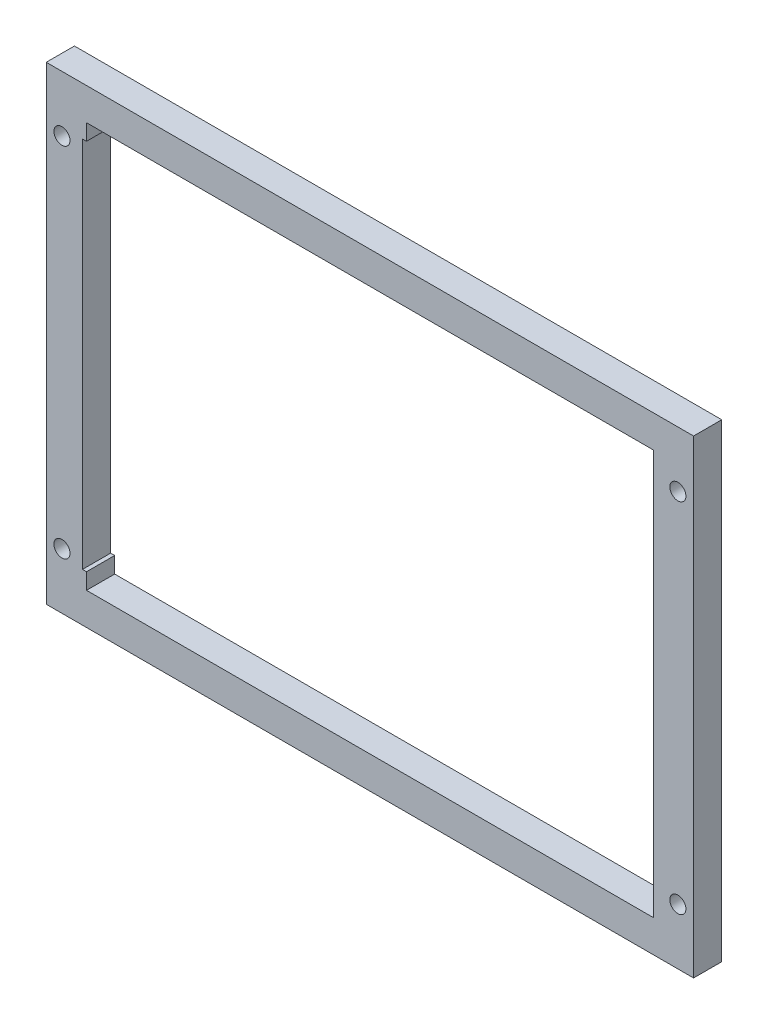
ISO-10303-21;
HEADER;
FILE_DESCRIPTION(('STEP AP214'),'2;1');
FILE_NAME('part.step','',(''),(''),'','','');
FILE_SCHEMA(('AUTOMOTIVE_DESIGN { 1 0 10303 214 1 1 1 1 }'));
ENDSEC;
DATA;
#1=APPLICATION_CONTEXT('core data for automotive mechanical design processes');
#2=APPLICATION_PROTOCOL_DEFINITION('international standard','automotive_design',2000,#1);
#3=PRODUCT_CONTEXT('',#1,'mechanical');
#4=PRODUCT('Part','Part','',(#3));
#5=PRODUCT_RELATED_PRODUCT_CATEGORY('part','',(#4));
#6=PRODUCT_DEFINITION_FORMATION('','',#4);
#7=PRODUCT_DEFINITION_CONTEXT('part definition',#1,'design');
#8=PRODUCT_DEFINITION('design','',#6,#7);
#9=PRODUCT_DEFINITION_SHAPE('','',#8);
#10=(LENGTH_UNIT() NAMED_UNIT(*) SI_UNIT(.MILLI.,.METRE.));
#11=(NAMED_UNIT(*) PLANE_ANGLE_UNIT() SI_UNIT($,.RADIAN.));
#12=(NAMED_UNIT(*) SI_UNIT($,.STERADIAN.) SOLID_ANGLE_UNIT());
#13=UNCERTAINTY_MEASURE_WITH_UNIT(LENGTH_MEASURE(1.E-05),#10,'distance_accuracy_value','');
#14=(GEOMETRIC_REPRESENTATION_CONTEXT(3) GLOBAL_UNCERTAINTY_ASSIGNED_CONTEXT((#13)) GLOBAL_UNIT_ASSIGNED_CONTEXT((#10,
#11,#12)) REPRESENTATION_CONTEXT('',''));
#15=CARTESIAN_POINT('',(0.,0.,0.));
#16=DIRECTION('',(0.,0.,1.));
#17=DIRECTION('',(1.,0.,0.));
#18=AXIS2_PLACEMENT_3D('',#15,#16,#17);
#19=CARTESIAN_POINT('',(0.,0.,3.5));
#20=DIRECTION('',(0.,0.,1.));
#21=DIRECTION('',(1.,0.,0.));
#22=AXIS2_PLACEMENT_3D('',#19,#20,#21);
#23=PLANE('',#22);
#24=CARTESIAN_POINT('',(38.25,22.2,3.5));
#25=DIRECTION('',(0.,0.,1.));
#26=DIRECTION('',(1.,0.,0.));
#27=AXIS2_PLACEMENT_3D('',#24,#25,#26);
#28=CIRCLE('',#27,0.999999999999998);
#29=CARTESIAN_POINT('',(39.25,22.2,3.5));
#30=VERTEX_POINT('',#29);
#31=EDGE_CURVE('E314',#30,#30,#28,.T.);
#32=ORIENTED_EDGE('',*,*,#31,.F.);
#33=EDGE_LOOP('',(#32));
#34=FACE_BOUND('',#33,.T.);
#35=CARTESIAN_POINT('',(-38.25,22.2,3.5));
#36=DIRECTION('',(0.,0.,1.));
#37=DIRECTION('',(1.,0.,0.));
#38=AXIS2_PLACEMENT_3D('',#35,#36,#37);
#39=CIRCLE('',#38,0.999999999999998);
#40=CARTESIAN_POINT('',(-37.25,22.2,3.5));
#41=VERTEX_POINT('',#40);
#42=EDGE_CURVE('E160',#41,#41,#39,.T.);
#43=ORIENTED_EDGE('',*,*,#42,.F.);
#44=EDGE_LOOP('',(#43));
#45=FACE_BOUND('',#44,.T.);
#46=DIRECTION('',(0.,-1.,0.));
#47=VECTOR('',#46,1.);
#48=CARTESIAN_POINT('',(-40.2,29.15,3.5));
#49=LINE('',#48,#47);
#50=CARTESIAN_POINT('',(-40.2,29.15,3.5));
#51=VERTEX_POINT('',#50);
#52=CARTESIAN_POINT('',(-40.2,-29.15,3.5));
#53=VERTEX_POINT('',#52);
#54=EDGE_CURVE('E190',#51,#53,#49,.T.);
#55=ORIENTED_EDGE('',*,*,#54,.T.);
#56=DIRECTION('',(1.,0.,0.));
#57=VECTOR('',#56,1.);
#58=CARTESIAN_POINT('',(-40.2,-29.15,3.5));
#59=LINE('',#58,#57);
#60=CARTESIAN_POINT('',(40.2,-29.15,3.5));
#61=VERTEX_POINT('',#60);
#62=EDGE_CURVE('E193',#53,#61,#59,.T.);
#63=ORIENTED_EDGE('',*,*,#62,.T.);
#64=DIRECTION('',(0.,1.,0.));
#65=VECTOR('',#64,1.);
#66=CARTESIAN_POINT('',(40.2,29.15,3.5));
#67=LINE('',#66,#65);
#68=CARTESIAN_POINT('',(40.2,29.15,3.5));
#69=VERTEX_POINT('',#68);
#70=EDGE_CURVE('E196',#61,#69,#67,.T.);
#71=ORIENTED_EDGE('',*,*,#70,.T.);
#72=DIRECTION('',(-1.,0.,0.));
#73=VECTOR('',#72,1.);
#74=CARTESIAN_POINT('',(-40.2,29.15,3.5));
#75=LINE('',#74,#73);
#76=EDGE_CURVE('E198',#69,#51,#75,.T.);
#77=ORIENTED_EDGE('',*,*,#76,.T.);
#78=EDGE_LOOP('',(#55,#63,#71,#77));
#79=FACE_BOUND('',#78,.T.);
#80=DIRECTION('',(-1.,0.,0.));
#81=VECTOR('',#80,1.);
#82=CARTESIAN_POINT('',(-35.2,23.15,3.5));
#83=LINE('',#82,#81);
#84=CARTESIAN_POINT('',(-35.2,23.15,3.5));
#85=VERTEX_POINT('',#84);
#86=CARTESIAN_POINT('',(-35.7,23.15,3.5));
#87=VERTEX_POINT('',#86);
#88=EDGE_CURVE('E130',#85,#87,#83,.T.);
#89=ORIENTED_EDGE('',*,*,#88,.F.);
#90=DIRECTION('',(0.,-1.,0.));
#91=VECTOR('',#90,1.);
#92=CARTESIAN_POINT('',(-35.2,25.15,3.5));
#93=LINE('',#92,#91);
#94=CARTESIAN_POINT('',(-35.2,25.15,3.5));
#95=VERTEX_POINT('',#94);
#96=EDGE_CURVE('E122',#95,#85,#93,.T.);
#97=ORIENTED_EDGE('',*,*,#96,.F.);
#98=DIRECTION('',(-1.,0.,0.));
#99=VECTOR('',#98,1.);
#100=CARTESIAN_POINT('',(-35.2,25.15,3.5));
#101=LINE('',#100,#99);
#102=CARTESIAN_POINT('',(35.2,25.15,3.5));
#103=VERTEX_POINT('',#102);
#104=EDGE_CURVE('E157',#103,#95,#101,.T.);
#105=ORIENTED_EDGE('',*,*,#104,.F.);
#106=DIRECTION('',(0.,1.,0.));
#107=VECTOR('',#106,1.);
#108=CARTESIAN_POINT('',(35.2,25.15,3.5));
#109=LINE('',#108,#107);
#110=CARTESIAN_POINT('',(35.2,-25.15,3.5));
#111=VERTEX_POINT('',#110);
#112=EDGE_CURVE('E155',#111,#103,#109,.T.);
#113=ORIENTED_EDGE('',*,*,#112,.F.);
#114=DIRECTION('',(1.,0.,0.));
#115=VECTOR('',#114,1.);
#116=CARTESIAN_POINT('',(-35.2,-25.15,3.5));
#117=LINE('',#116,#115);
#118=CARTESIAN_POINT('',(-35.2,-25.15,3.5));
#119=VERTEX_POINT('',#118);
#120=EDGE_CURVE('E153',#119,#111,#117,.T.);
#121=ORIENTED_EDGE('',*,*,#120,.F.);
#122=DIRECTION('',(0.,-1.,0.));
#123=VECTOR('',#122,1.);
#124=CARTESIAN_POINT('',(-35.2,-23.15,3.5));
#125=LINE('',#124,#123);
#126=CARTESIAN_POINT('',(-35.2,-23.15,3.5));
#127=VERTEX_POINT('',#126);
#128=EDGE_CURVE('E151',#127,#119,#125,.T.);
#129=ORIENTED_EDGE('',*,*,#128,.F.);
#130=DIRECTION('',(1.,0.,0.));
#131=VECTOR('',#130,1.);
#132=CARTESIAN_POINT('',(-35.7,-23.15,3.5));
#133=LINE('',#132,#131);
#134=CARTESIAN_POINT('',(-35.7,-23.15,3.5));
#135=VERTEX_POINT('',#134);
#136=EDGE_CURVE('E146',#135,#127,#133,.T.);
#137=ORIENTED_EDGE('',*,*,#136,.F.);
#138=DIRECTION('',(0.,-1.,0.));
#139=VECTOR('',#138,1.);
#140=CARTESIAN_POINT('',(-35.7,23.15,3.5));
#141=LINE('',#140,#139);
#142=EDGE_CURVE('E144',#87,#135,#141,.T.);
#143=ORIENTED_EDGE('',*,*,#142,.F.);
#144=EDGE_LOOP('',(#89,#97,#105,#113,#121,#129,#137,#143));
#145=FACE_BOUND('',#144,.T.);
#146=CARTESIAN_POINT('',(-38.25,-22.2,3.5));
#147=DIRECTION('',(0.,0.,1.));
#148=DIRECTION('',(1.,0.,0.));
#149=AXIS2_PLACEMENT_3D('',#146,#147,#148);
#150=CIRCLE('',#149,0.999999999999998);
#151=CARTESIAN_POINT('',(-37.25,-22.2,3.5));
#152=VERTEX_POINT('',#151);
#153=EDGE_CURVE('E320',#152,#152,#150,.T.);
#154=ORIENTED_EDGE('',*,*,#153,.F.);
#155=EDGE_LOOP('',(#154));
#156=FACE_BOUND('',#155,.T.);
#157=CARTESIAN_POINT('',(38.25,-22.2,3.5));
#158=DIRECTION('',(0.,0.,1.));
#159=DIRECTION('',(1.,0.,0.));
#160=AXIS2_PLACEMENT_3D('',#157,#158,#159);
#161=CIRCLE('',#160,0.999999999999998);
#162=CARTESIAN_POINT('',(39.25,-22.2,3.5));
#163=VERTEX_POINT('',#162);
#164=EDGE_CURVE('E305',#163,#163,#161,.T.);
#165=ORIENTED_EDGE('',*,*,#164,.F.);
#166=EDGE_LOOP('',(#165));
#167=FACE_BOUND('',#166,.T.);
#168=ADVANCED_FACE('F33',(#34,#45,#79,#145,#156,#167),#23,.T.);
#169=CARTESIAN_POINT('',(0.,0.,0.));
#170=DIRECTION('',(0.,0.,1.));
#171=DIRECTION('',(1.,0.,0.));
#172=AXIS2_PLACEMENT_3D('',#169,#170,#171);
#173=PLANE('',#172);
#174=DIRECTION('',(0.,-1.,0.));
#175=VECTOR('',#174,1.);
#176=CARTESIAN_POINT('',(-40.2,29.15,0.));
#177=LINE('',#176,#175);
#178=CARTESIAN_POINT('',(-40.2,29.15,0.));
#179=VERTEX_POINT('',#178);
#180=CARTESIAN_POINT('',(-40.2,-29.15,0.));
#181=VERTEX_POINT('',#180);
#182=EDGE_CURVE('E138',#179,#181,#177,.T.);
#183=ORIENTED_EDGE('',*,*,#182,.F.);
#184=DIRECTION('',(-1.,0.,0.));
#185=VECTOR('',#184,1.);
#186=CARTESIAN_POINT('',(-40.2,29.15,0.));
#187=LINE('',#186,#185);
#188=CARTESIAN_POINT('',(40.2,29.15,0.));
#189=VERTEX_POINT('',#188);
#190=EDGE_CURVE('E194',#189,#179,#187,.T.);
#191=ORIENTED_EDGE('',*,*,#190,.F.);
#192=DIRECTION('',(0.,1.,0.));
#193=VECTOR('',#192,1.);
#194=CARTESIAN_POINT('',(40.2,29.15,0.));
#195=LINE('',#194,#193);
#196=CARTESIAN_POINT('',(40.2,-29.15,0.));
#197=VERTEX_POINT('',#196);
#198=EDGE_CURVE('E205',#197,#189,#195,.T.);
#199=ORIENTED_EDGE('',*,*,#198,.F.);
#200=DIRECTION('',(1.,0.,0.));
#201=VECTOR('',#200,1.);
#202=CARTESIAN_POINT('',(-40.2,-29.15,0.));
#203=LINE('',#202,#201);
#204=EDGE_CURVE('E203',#181,#197,#203,.T.);
#205=ORIENTED_EDGE('',*,*,#204,.F.);
#206=EDGE_LOOP('',(#183,#191,#199,#205));
#207=FACE_BOUND('',#206,.T.);
#208=DIRECTION('',(0.,-1.,0.));
#209=VECTOR('',#208,1.);
#210=CARTESIAN_POINT('',(-35.2,25.15,0.));
#211=LINE('',#210,#209);
#212=CARTESIAN_POINT('',(-35.2,25.15,0.));
#213=VERTEX_POINT('',#212);
#214=CARTESIAN_POINT('',(-35.2,23.15,0.));
#215=VERTEX_POINT('',#214);
#216=EDGE_CURVE('E56',#213,#215,#211,.T.);
#217=ORIENTED_EDGE('',*,*,#216,.T.);
#218=DIRECTION('',(-1.,0.,0.));
#219=VECTOR('',#218,1.);
#220=CARTESIAN_POINT('',(-35.2,23.15,0.));
#221=LINE('',#220,#219);
#222=CARTESIAN_POINT('',(-35.7,23.15,0.));
#223=VERTEX_POINT('',#222);
#224=EDGE_CURVE('E137',#215,#223,#221,.T.);
#225=ORIENTED_EDGE('',*,*,#224,.T.);
#226=DIRECTION('',(0.,-1.,0.));
#227=VECTOR('',#226,1.);
#228=CARTESIAN_POINT('',(-35.7,23.15,0.));
#229=LINE('',#228,#227);
#230=CARTESIAN_POINT('',(-35.7,-23.15,0.));
#231=VERTEX_POINT('',#230);
#232=EDGE_CURVE('E162',#223,#231,#229,.T.);
#233=ORIENTED_EDGE('',*,*,#232,.T.);
#234=DIRECTION('',(1.,0.,0.));
#235=VECTOR('',#234,1.);
#236=CARTESIAN_POINT('',(-35.7,-23.15,0.));
#237=LINE('',#236,#235);
#238=CARTESIAN_POINT('',(-35.2,-23.15,0.));
#239=VERTEX_POINT('',#238);
#240=EDGE_CURVE('E165',#231,#239,#237,.T.);
#241=ORIENTED_EDGE('',*,*,#240,.T.);
#242=DIRECTION('',(0.,-1.,0.));
#243=VECTOR('',#242,1.);
#244=CARTESIAN_POINT('',(-35.2,-23.15,0.));
#245=LINE('',#244,#243);
#246=CARTESIAN_POINT('',(-35.2,-25.15,0.));
#247=VERTEX_POINT('',#246);
#248=EDGE_CURVE('E168',#239,#247,#245,.T.);
#249=ORIENTED_EDGE('',*,*,#248,.T.);
#250=DIRECTION('',(1.,0.,0.));
#251=VECTOR('',#250,1.);
#252=CARTESIAN_POINT('',(-35.2,-25.15,0.));
#253=LINE('',#252,#251);
#254=CARTESIAN_POINT('',(35.2,-25.15,0.));
#255=VERTEX_POINT('',#254);
#256=EDGE_CURVE('E171',#247,#255,#253,.T.);
#257=ORIENTED_EDGE('',*,*,#256,.T.);
#258=DIRECTION('',(0.,1.,0.));
#259=VECTOR('',#258,1.);
#260=CARTESIAN_POINT('',(35.2,25.15,0.));
#261=LINE('',#260,#259);
#262=CARTESIAN_POINT('',(35.2,25.15,0.));
#263=VERTEX_POINT('',#262);
#264=EDGE_CURVE('E174',#255,#263,#261,.T.);
#265=ORIENTED_EDGE('',*,*,#264,.T.);
#266=DIRECTION('',(-1.,0.,0.));
#267=VECTOR('',#266,1.);
#268=CARTESIAN_POINT('',(-35.2,25.15,0.));
#269=LINE('',#268,#267);
#270=EDGE_CURVE('E131',#263,#213,#269,.T.);
#271=ORIENTED_EDGE('',*,*,#270,.T.);
#272=EDGE_LOOP('',(#217,#225,#233,#241,#249,#257,#265,#271));
#273=FACE_BOUND('',#272,.T.);
#274=CARTESIAN_POINT('',(-38.25,22.2,0.));
#275=DIRECTION('',(0.,0.,1.));
#276=DIRECTION('',(1.,0.,0.));
#277=AXIS2_PLACEMENT_3D('',#274,#275,#276);
#278=CIRCLE('',#277,0.999999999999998);
#279=CARTESIAN_POINT('',(-37.25,22.2,0.));
#280=VERTEX_POINT('',#279);
#281=EDGE_CURVE('E323',#280,#280,#278,.T.);
#282=ORIENTED_EDGE('',*,*,#281,.T.);
#283=EDGE_LOOP('',(#282));
#284=FACE_BOUND('',#283,.T.);
#285=CARTESIAN_POINT('',(-38.25,-22.2,0.));
#286=DIRECTION('',(0.,0.,1.));
#287=DIRECTION('',(1.,0.,0.));
#288=AXIS2_PLACEMENT_3D('',#285,#286,#287);
#289=CIRCLE('',#288,0.999999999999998);
#290=CARTESIAN_POINT('',(-37.25,-22.2,0.));
#291=VERTEX_POINT('',#290);
#292=EDGE_CURVE('E317',#291,#291,#289,.T.);
#293=ORIENTED_EDGE('',*,*,#292,.T.);
#294=EDGE_LOOP('',(#293));
#295=FACE_BOUND('',#294,.T.);
#296=CARTESIAN_POINT('',(38.25,22.2,0.));
#297=DIRECTION('',(0.,0.,1.));
#298=DIRECTION('',(1.,0.,0.));
#299=AXIS2_PLACEMENT_3D('',#296,#297,#298);
#300=CIRCLE('',#299,0.999999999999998);
#301=CARTESIAN_POINT('',(39.25,22.2,0.));
#302=VERTEX_POINT('',#301);
#303=EDGE_CURVE('E311',#302,#302,#300,.T.);
#304=ORIENTED_EDGE('',*,*,#303,.T.);
#305=EDGE_LOOP('',(#304));
#306=FACE_BOUND('',#305,.T.);
#307=CARTESIAN_POINT('',(38.25,-22.2,0.));
#308=DIRECTION('',(0.,0.,1.));
#309=DIRECTION('',(1.,0.,0.));
#310=AXIS2_PLACEMENT_3D('',#307,#308,#309);
#311=CIRCLE('',#310,0.999999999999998);
#312=CARTESIAN_POINT('',(39.25,-22.2,0.));
#313=VERTEX_POINT('',#312);
#314=EDGE_CURVE('E308',#313,#313,#311,.T.);
#315=ORIENTED_EDGE('',*,*,#314,.T.);
#316=EDGE_LOOP('',(#315));
#317=FACE_BOUND('',#316,.T.);
#318=ADVANCED_FACE('F223',(#207,#273,#284,#295,#306,#317),#173,.F.);
#319=CARTESIAN_POINT('',(-40.2,29.15,3.5));
#320=DIRECTION('',(1.,0.,0.));
#321=DIRECTION('',(0.,1.,0.));
#322=AXIS2_PLACEMENT_3D('',#319,#320,#321);
#323=PLANE('',#322);
#324=ORIENTED_EDGE('',*,*,#182,.T.);
#325=DIRECTION('',(0.,0.,-1.));
#326=VECTOR('',#325,1.);
#327=CARTESIAN_POINT('',(-40.2,-29.15,3.5));
#328=LINE('',#327,#326);
#329=EDGE_CURVE('E11',#53,#181,#328,.T.);
#330=ORIENTED_EDGE('',*,*,#329,.F.);
#331=ORIENTED_EDGE('',*,*,#54,.F.);
#332=DIRECTION('',(0.,0.,-1.));
#333=VECTOR('',#332,1.);
#334=CARTESIAN_POINT('',(-40.2,29.15,3.5));
#335=LINE('',#334,#333);
#336=EDGE_CURVE('E200',#51,#179,#335,.T.);
#337=ORIENTED_EDGE('',*,*,#336,.T.);
#338=EDGE_LOOP('',(#324,#330,#331,#337));
#339=FACE_BOUND('',#338,.T.);
#340=ADVANCED_FACE('F35',(#339),#323,.F.);
#341=CARTESIAN_POINT('',(-40.2,-29.15,3.5));
#342=DIRECTION('',(0.,1.,0.));
#343=DIRECTION('',(0.,0.,1.));
#344=AXIS2_PLACEMENT_3D('',#341,#342,#343);
#345=PLANE('',#344);
#346=ORIENTED_EDGE('',*,*,#204,.T.);
#347=DIRECTION('',(0.,0.,-1.));
#348=VECTOR('',#347,1.);
#349=CARTESIAN_POINT('',(40.2,-29.15,3.5));
#350=LINE('',#349,#348);
#351=EDGE_CURVE('E41',#61,#197,#350,.T.);
#352=ORIENTED_EDGE('',*,*,#351,.F.);
#353=ORIENTED_EDGE('',*,*,#62,.F.);
#354=ORIENTED_EDGE('',*,*,#329,.T.);
#355=EDGE_LOOP('',(#346,#352,#353,#354));
#356=FACE_BOUND('',#355,.T.);
#357=ADVANCED_FACE('F233',(#356),#345,.F.);
#358=CARTESIAN_POINT('',(40.2,29.15,3.5));
#359=DIRECTION('',(-1.,0.,0.));
#360=DIRECTION('',(0.,-1.,0.));
#361=AXIS2_PLACEMENT_3D('',#358,#359,#360);
#362=PLANE('',#361);
#363=ORIENTED_EDGE('',*,*,#198,.T.);
#364=DIRECTION('',(0.,0.,-1.));
#365=VECTOR('',#364,1.);
#366=CARTESIAN_POINT('',(40.2,29.15,3.5));
#367=LINE('',#366,#365);
#368=EDGE_CURVE('E210',#69,#189,#367,.T.);
#369=ORIENTED_EDGE('',*,*,#368,.F.);
#370=ORIENTED_EDGE('',*,*,#70,.F.);
#371=ORIENTED_EDGE('',*,*,#351,.T.);
#372=EDGE_LOOP('',(#363,#369,#370,#371));
#373=FACE_BOUND('',#372,.T.);
#374=ADVANCED_FACE('F217',(#373),#362,.F.);
#375=CARTESIAN_POINT('',(-40.2,29.15,3.5));
#376=DIRECTION('',(0.,-1.,0.));
#377=DIRECTION('',(0.,0.,-1.));
#378=AXIS2_PLACEMENT_3D('',#375,#376,#377);
#379=PLANE('',#378);
#380=ORIENTED_EDGE('',*,*,#190,.T.);
#381=ORIENTED_EDGE('',*,*,#336,.F.);
#382=ORIENTED_EDGE('',*,*,#76,.F.);
#383=ORIENTED_EDGE('',*,*,#368,.T.);
#384=EDGE_LOOP('',(#380,#381,#382,#383));
#385=FACE_BOUND('',#384,.T.);
#386=ADVANCED_FACE('F227',(#385),#379,.F.);
#387=CARTESIAN_POINT('',(-35.2,25.15,3.5));
#388=DIRECTION('',(1.,0.,0.));
#389=DIRECTION('',(0.,0.,-1.));
#390=AXIS2_PLACEMENT_3D('',#387,#388,#389);
#391=PLANE('',#390);
#392=ORIENTED_EDGE('',*,*,#216,.F.);
#393=DIRECTION('',(0.,0.,-1.));
#394=VECTOR('',#393,1.);
#395=CARTESIAN_POINT('',(-35.2,25.15,3.5));
#396=LINE('',#395,#394);
#397=EDGE_CURVE('E126',#95,#213,#396,.T.);
#398=ORIENTED_EDGE('',*,*,#397,.F.);
#399=ORIENTED_EDGE('',*,*,#96,.T.);
#400=DIRECTION('',(0.,0.,-1.));
#401=VECTOR('',#400,1.);
#402=CARTESIAN_POINT('',(-35.2,23.15,3.5));
#403=LINE('',#402,#401);
#404=EDGE_CURVE('E125',#85,#215,#403,.T.);
#405=ORIENTED_EDGE('',*,*,#404,.T.);
#406=EDGE_LOOP('',(#392,#398,#399,#405));
#407=FACE_BOUND('',#406,.T.);
#408=ADVANCED_FACE('F124',(#407),#391,.T.);
#409=CARTESIAN_POINT('',(-35.2,23.15,3.5));
#410=DIRECTION('',(0.,-1.,0.));
#411=DIRECTION('',(0.,0.,-1.));
#412=AXIS2_PLACEMENT_3D('',#409,#410,#411);
#413=PLANE('',#412);
#414=ORIENTED_EDGE('',*,*,#224,.F.);
#415=ORIENTED_EDGE('',*,*,#404,.F.);
#416=ORIENTED_EDGE('',*,*,#88,.T.);
#417=DIRECTION('',(0.,0.,-1.));
#418=VECTOR('',#417,1.);
#419=CARTESIAN_POINT('',(-35.7,23.15,3.5));
#420=LINE('',#419,#418);
#421=EDGE_CURVE('E139',#87,#223,#420,.T.);
#422=ORIENTED_EDGE('',*,*,#421,.T.);
#423=EDGE_LOOP('',(#414,#415,#416,#422));
#424=FACE_BOUND('',#423,.T.);
#425=ADVANCED_FACE('F134',(#424),#413,.T.);
#426=CARTESIAN_POINT('',(-35.7,23.15,3.5));
#427=DIRECTION('',(1.,0.,0.));
#428=DIRECTION('',(0.,0.,-1.));
#429=AXIS2_PLACEMENT_3D('',#426,#427,#428);
#430=PLANE('',#429);
#431=ORIENTED_EDGE('',*,*,#232,.F.);
#432=ORIENTED_EDGE('',*,*,#421,.F.);
#433=ORIENTED_EDGE('',*,*,#142,.T.);
#434=DIRECTION('',(0.,0.,-1.));
#435=VECTOR('',#434,1.);
#436=CARTESIAN_POINT('',(-35.7,-23.15,3.5));
#437=LINE('',#436,#435);
#438=EDGE_CURVE('E187',#135,#231,#437,.T.);
#439=ORIENTED_EDGE('',*,*,#438,.T.);
#440=EDGE_LOOP('',(#431,#432,#433,#439));
#441=FACE_BOUND('',#440,.T.);
#442=ADVANCED_FACE('F259',(#441),#430,.T.);
#443=CARTESIAN_POINT('',(-35.7,-23.15,3.5));
#444=DIRECTION('',(0.,1.,0.));
#445=DIRECTION('',(0.,0.,1.));
#446=AXIS2_PLACEMENT_3D('',#443,#444,#445);
#447=PLANE('',#446);
#448=ORIENTED_EDGE('',*,*,#240,.F.);
#449=ORIENTED_EDGE('',*,*,#438,.F.);
#450=ORIENTED_EDGE('',*,*,#136,.T.);
#451=DIRECTION('',(0.,0.,-1.));
#452=VECTOR('',#451,1.);
#453=CARTESIAN_POINT('',(-35.2,-23.15,3.5));
#454=LINE('',#453,#452);
#455=EDGE_CURVE('E185',#127,#239,#454,.T.);
#456=ORIENTED_EDGE('',*,*,#455,.T.);
#457=EDGE_LOOP('',(#448,#449,#450,#456));
#458=FACE_BOUND('',#457,.T.);
#459=ADVANCED_FACE('F263',(#458),#447,.T.);
#460=CARTESIAN_POINT('',(-35.2,-23.15,3.5));
#461=DIRECTION('',(1.,0.,0.));
#462=DIRECTION('',(0.,1.,0.));
#463=AXIS2_PLACEMENT_3D('',#460,#461,#462);
#464=PLANE('',#463);
#465=ORIENTED_EDGE('',*,*,#248,.F.);
#466=ORIENTED_EDGE('',*,*,#455,.F.);
#467=ORIENTED_EDGE('',*,*,#128,.T.);
#468=DIRECTION('',(0.,0.,-1.));
#469=VECTOR('',#468,1.);
#470=CARTESIAN_POINT('',(-35.2,-25.15,3.5));
#471=LINE('',#470,#469);
#472=EDGE_CURVE('E183',#119,#247,#471,.T.);
#473=ORIENTED_EDGE('',*,*,#472,.T.);
#474=EDGE_LOOP('',(#465,#466,#467,#473));
#475=FACE_BOUND('',#474,.T.);
#476=ADVANCED_FACE('F269',(#475),#464,.T.);
#477=CARTESIAN_POINT('',(-35.2,-25.15,3.5));
#478=DIRECTION('',(0.,1.,0.));
#479=DIRECTION('',(0.,0.,1.));
#480=AXIS2_PLACEMENT_3D('',#477,#478,#479);
#481=PLANE('',#480);
#482=ORIENTED_EDGE('',*,*,#256,.F.);
#483=ORIENTED_EDGE('',*,*,#472,.F.);
#484=ORIENTED_EDGE('',*,*,#120,.T.);
#485=DIRECTION('',(0.,0.,-1.));
#486=VECTOR('',#485,1.);
#487=CARTESIAN_POINT('',(35.2,-25.15,3.5));
#488=LINE('',#487,#486);
#489=EDGE_CURVE('E181',#111,#255,#488,.T.);
#490=ORIENTED_EDGE('',*,*,#489,.T.);
#491=EDGE_LOOP('',(#482,#483,#484,#490));
#492=FACE_BOUND('',#491,.T.);
#493=ADVANCED_FACE('F273',(#492),#481,.T.);
#494=CARTESIAN_POINT('',(35.2,25.15,3.5));
#495=DIRECTION('',(-1.,0.,0.));
#496=DIRECTION('',(0.,0.,1.));
#497=AXIS2_PLACEMENT_3D('',#494,#495,#496);
#498=PLANE('',#497);
#499=ORIENTED_EDGE('',*,*,#264,.F.);
#500=ORIENTED_EDGE('',*,*,#489,.F.);
#501=ORIENTED_EDGE('',*,*,#112,.T.);
#502=DIRECTION('',(0.,0.,-1.));
#503=VECTOR('',#502,1.);
#504=CARTESIAN_POINT('',(35.2,25.15,3.5));
#505=LINE('',#504,#503);
#506=EDGE_CURVE('E48',#103,#263,#505,.T.);
#507=ORIENTED_EDGE('',*,*,#506,.T.);
#508=EDGE_LOOP('',(#499,#500,#501,#507));
#509=FACE_BOUND('',#508,.T.);
#510=ADVANCED_FACE('F277',(#509),#498,.T.);
#511=CARTESIAN_POINT('',(-35.2,25.15,3.5));
#512=DIRECTION('',(0.,-1.,0.));
#513=DIRECTION('',(0.,0.,-1.));
#514=AXIS2_PLACEMENT_3D('',#511,#512,#513);
#515=PLANE('',#514);
#516=ORIENTED_EDGE('',*,*,#270,.F.);
#517=ORIENTED_EDGE('',*,*,#506,.F.);
#518=ORIENTED_EDGE('',*,*,#104,.T.);
#519=ORIENTED_EDGE('',*,*,#397,.T.);
#520=EDGE_LOOP('',(#516,#517,#518,#519));
#521=FACE_BOUND('',#520,.T.);
#522=ADVANCED_FACE('F281',(#521),#515,.T.);
#523=CARTESIAN_POINT('',(-38.25,22.2,3.5));
#524=DIRECTION('',(0.,0.,-1.));
#525=DIRECTION('',(-1.,0.,0.));
#526=AXIS2_PLACEMENT_3D('',#523,#524,#525);
#527=CYLINDRICAL_SURFACE('',#526,0.999999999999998);
#528=ORIENTED_EDGE('',*,*,#42,.T.);
#529=EDGE_LOOP('',(#528));
#530=FACE_BOUND('',#529,.T.);
#531=ORIENTED_EDGE('',*,*,#281,.F.);
#532=EDGE_LOOP('',(#531));
#533=FACE_BOUND('',#532,.T.);
#534=ADVANCED_FACE('F285',(#530,#533),#527,.F.);
#535=CARTESIAN_POINT('',(-38.25,-22.2,3.5));
#536=DIRECTION('',(0.,0.,-1.));
#537=DIRECTION('',(-1.,0.,0.));
#538=AXIS2_PLACEMENT_3D('',#535,#536,#537);
#539=CYLINDRICAL_SURFACE('',#538,0.999999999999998);
#540=ORIENTED_EDGE('',*,*,#153,.T.);
#541=EDGE_LOOP('',(#540));
#542=FACE_BOUND('',#541,.T.);
#543=ORIENTED_EDGE('',*,*,#292,.F.);
#544=EDGE_LOOP('',(#543));
#545=FACE_BOUND('',#544,.T.);
#546=ADVANCED_FACE('F288',(#542,#545),#539,.F.);
#547=CARTESIAN_POINT('',(38.25,22.2,3.5));
#548=DIRECTION('',(0.,0.,-1.));
#549=DIRECTION('',(-1.,0.,0.));
#550=AXIS2_PLACEMENT_3D('',#547,#548,#549);
#551=CYLINDRICAL_SURFACE('',#550,0.999999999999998);
#552=ORIENTED_EDGE('',*,*,#31,.T.);
#553=EDGE_LOOP('',(#552));
#554=FACE_BOUND('',#553,.T.);
#555=ORIENTED_EDGE('',*,*,#303,.F.);
#556=EDGE_LOOP('',(#555));
#557=FACE_BOUND('',#556,.T.);
#558=ADVANCED_FACE('F292',(#554,#557),#551,.F.);
#559=CARTESIAN_POINT('',(38.25,-22.2,3.5));
#560=DIRECTION('',(0.,0.,-1.));
#561=DIRECTION('',(-1.,0.,0.));
#562=AXIS2_PLACEMENT_3D('',#559,#560,#561);
#563=CYLINDRICAL_SURFACE('',#562,0.999999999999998);
#564=ORIENTED_EDGE('',*,*,#164,.T.);
#565=EDGE_LOOP('',(#564));
#566=FACE_BOUND('',#565,.T.);
#567=ORIENTED_EDGE('',*,*,#314,.F.);
#568=EDGE_LOOP('',(#567));
#569=FACE_BOUND('',#568,.T.);
#570=ADVANCED_FACE('F296',(#566,#569),#563,.F.);
#571=CLOSED_SHELL('',(#168,#318,#340,#357,#374,#386,#408,#425,#442,#459,#476,#493,#510,#522,
#534,#546,#558,#570));
#572=MANIFOLD_SOLID_BREP('B2',#571);
#573=ADVANCED_BREP_SHAPE_REPRESENTATION('',(#18,#572),#14);
#574=SHAPE_DEFINITION_REPRESENTATION(#9,#573);
ENDSEC;
END-ISO-10303-21;
